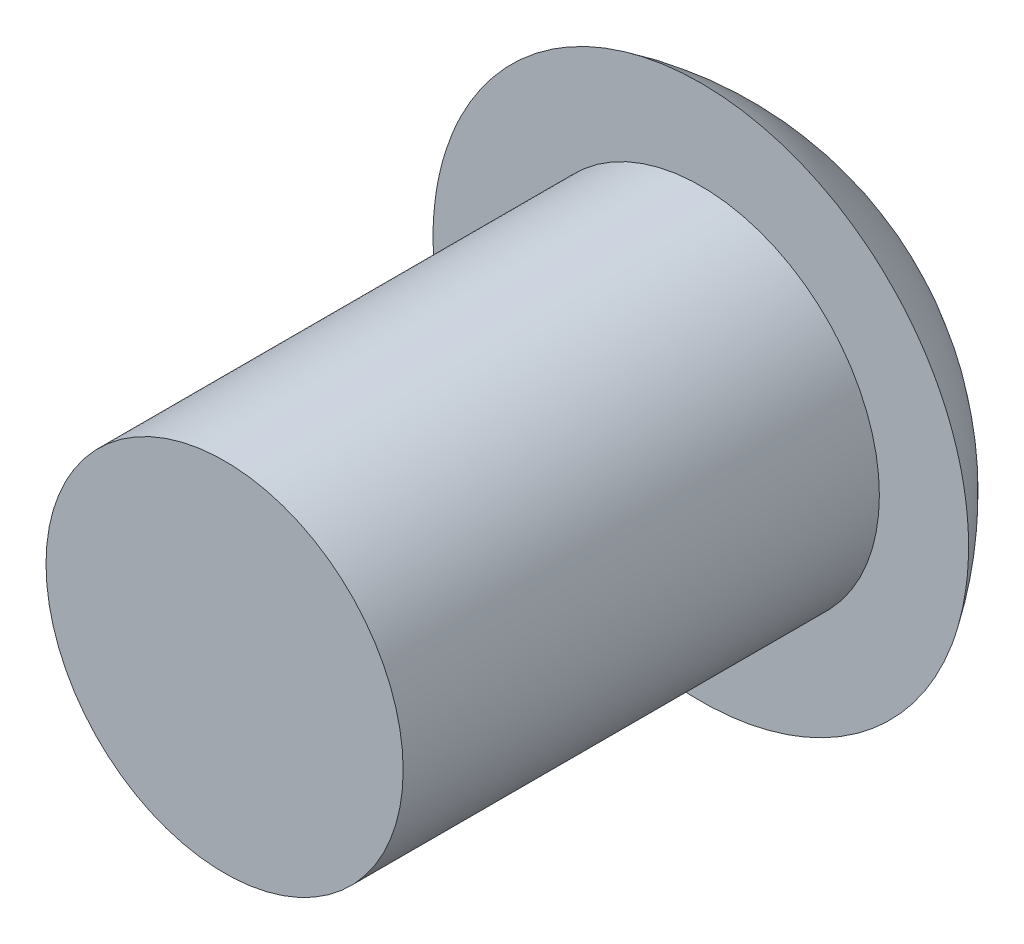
ISO-10303-21;
HEADER;
FILE_DESCRIPTION(('STEP AP214'),'2;1');
FILE_NAME('part.step','',(''),(''),'','','');
FILE_SCHEMA(('AUTOMOTIVE_DESIGN { 1 0 10303 214 1 1 1 1 }'));
ENDSEC;
DATA;
#1=APPLICATION_CONTEXT('core data for automotive mechanical design processes');
#2=APPLICATION_PROTOCOL_DEFINITION('international standard','automotive_design',2000,#1);
#3=PRODUCT_CONTEXT('',#1,'mechanical');
#4=PRODUCT('Part','Part','',(#3));
#5=PRODUCT_RELATED_PRODUCT_CATEGORY('part','',(#4));
#6=PRODUCT_DEFINITION_FORMATION('','',#4);
#7=PRODUCT_DEFINITION_CONTEXT('part definition',#1,'design');
#8=PRODUCT_DEFINITION('design','',#6,#7);
#9=PRODUCT_DEFINITION_SHAPE('','',#8);
#10=(LENGTH_UNIT() NAMED_UNIT(*) SI_UNIT(.MILLI.,.METRE.));
#11=(NAMED_UNIT(*) PLANE_ANGLE_UNIT() SI_UNIT($,.RADIAN.));
#12=(NAMED_UNIT(*) SI_UNIT($,.STERADIAN.) SOLID_ANGLE_UNIT());
#13=UNCERTAINTY_MEASURE_WITH_UNIT(LENGTH_MEASURE(1.E-05),#10,'distance_accuracy_value','');
#14=(GEOMETRIC_REPRESENTATION_CONTEXT(3) GLOBAL_UNCERTAINTY_ASSIGNED_CONTEXT((#13)) GLOBAL_UNIT_ASSIGNED_CONTEXT((#10,
#11,#12)) REPRESENTATION_CONTEXT('',''));
#15=CARTESIAN_POINT('',(0.,0.,0.));
#16=DIRECTION('',(0.,0.,1.));
#17=DIRECTION('',(1.,0.,0.));
#18=AXIS2_PLACEMENT_3D('',#15,#16,#17);
#19=CARTESIAN_POINT('',(-4.064,11.1125,2.44475));
#20=DIRECTION('',(0.,0.,1.));
#21=DIRECTION('',(1.,0.,0.));
#22=AXIS2_PLACEMENT_3D('',#19,#20,#21);
#23=PLANE('',#22);
#24=CARTESIAN_POINT('',(-4.064,11.1125,2.44475));
#25=DIRECTION('',(0.,0.,1.));
#26=DIRECTION('',(1.,0.,0.));
#27=AXIS2_PLACEMENT_3D('',#24,#25,#26);
#28=CIRCLE('',#27,1.190625);
#29=CARTESIAN_POINT('',(-2.873375,11.1125,2.44475));
#30=VERTEX_POINT('',#29);
#31=EDGE_CURVE('E21',#30,#30,#28,.F.);
#32=ORIENTED_EDGE('',*,*,#31,.F.);
#33=EDGE_LOOP('',(#32));
#34=FACE_BOUND('',#33,.T.);
#35=ADVANCED_FACE('F15',(#34),#23,.T.);
#36=CARTESIAN_POINT('',(-4.064,11.1125,-0.73025));
#37=DIRECTION('',(0.,0.,1.));
#38=DIRECTION('',(1.,0.,0.));
#39=AXIS2_PLACEMENT_3D('',#36,#37,#38);
#40=CYLINDRICAL_SURFACE('',#39,1.190625);
#41=ORIENTED_EDGE('',*,*,#31,.T.);
#42=EDGE_LOOP('',(#41));
#43=FACE_BOUND('',#42,.T.);
#44=CARTESIAN_POINT('',(-4.064,11.1125,-0.73025));
#45=DIRECTION('',(0.,0.,1.));
#46=DIRECTION('',(1.,0.,0.));
#47=AXIS2_PLACEMENT_3D('',#44,#45,#46);
#48=CIRCLE('',#47,1.190625);
#49=CARTESIAN_POINT('',(-2.873375,11.1125,-0.73025));
#50=VERTEX_POINT('',#49);
#51=EDGE_CURVE('E25',#50,#50,#48,.T.);
#52=ORIENTED_EDGE('',*,*,#51,.T.);
#53=EDGE_LOOP('',(#52));
#54=FACE_BOUND('',#53,.T.);
#55=ADVANCED_FACE('F37',(#43,#54),#40,.T.);
#56=CARTESIAN_POINT('',(-4.064,9.32725760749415,-0.73025));
#57=DIRECTION('',(0.,0.,-1.));
#58=DIRECTION('',(-1.,0.,0.));
#59=AXIS2_PLACEMENT_3D('',#56,#57,#58);
#60=PLANE('',#59);
#61=CARTESIAN_POINT('',(-5.84924239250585,11.1125,-0.73025));
#62=CARTESIAN_POINT('',(-5.84923794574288,11.2127778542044,-0.73025));
#63=CARTESIAN_POINT('',(-5.84076506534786,11.3131284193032,-0.73025));
#64=CARTESIAN_POINT('',(-5.80708264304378,11.5110658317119,-0.73025));
#65=CARTESIAN_POINT('',(-5.78185295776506,11.6086492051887,-0.73025));
#66=CARTESIAN_POINT('',(-5.71537515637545,11.7981559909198,-0.73025));
#67=CARTESIAN_POINT('',(-5.67413469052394,11.890082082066,-0.73025));
#68=CARTESIAN_POINT('',(-5.57681650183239,12.0656800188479,-0.73025));
#69=CARTESIAN_POINT('',(-5.52074246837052,12.1493539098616,-0.73025));
#70=CARTESIAN_POINT('',(-5.39533755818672,12.3061104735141,-0.730250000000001));
#71=CARTESIAN_POINT('',(-5.32600529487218,12.3791920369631,-0.730250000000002));
#72=CARTESIAN_POINT('',(-5.17605274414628,12.5126806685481,-0.730249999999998));
#73=CARTESIAN_POINT('',(-5.09543201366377,12.5730872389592,-0.730249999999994));
#74=CARTESIAN_POINT('',(-4.92519488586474,12.6795066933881,-0.730249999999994));
#75=CARTESIAN_POINT('',(-4.83557865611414,12.7255198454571,-0.730249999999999));
#76=CARTESIAN_POINT('',(-4.64989339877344,12.8018476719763,-0.730250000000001));
#77=CARTESIAN_POINT('',(-4.55382438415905,12.8321623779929,-0.730249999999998));
#78=CARTESIAN_POINT('',(-4.35796032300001,12.8762329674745,-0.730249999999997));
#79=CARTESIAN_POINT('',(-4.25816526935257,12.8899888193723,-0.730249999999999));
#80=CARTESIAN_POINT('',(-4.05768237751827,12.9005510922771,-0.730250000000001));
#81=CARTESIAN_POINT('',(-3.95699454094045,12.8973575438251,-0.73025));
#82=CARTESIAN_POINT('',(-3.7575840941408,12.874111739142,-0.730249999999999));
#83=CARTESIAN_POINT('',(-3.65886148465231,12.8540594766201,-0.73025));
#84=CARTESIAN_POINT('',(-3.46618387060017,12.7976654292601,-0.73025));
#85=CARTESIAN_POINT('',(-3.37222887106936,12.7613236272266,-0.73025));
#86=CARTESIAN_POINT('',(-3.19175372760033,12.6733821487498,-0.73025));
#87=CARTESIAN_POINT('',(-3.10523358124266,12.6217824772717,-0.73025));
#88=CARTESIAN_POINT('',(-2.94208419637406,12.5047900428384,-0.73025));
#89=CARTESIAN_POINT('',(-2.86545495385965,12.4393972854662,-0.73025));
#90=CARTESIAN_POINT('',(-2.7242626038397,12.2966749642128,-0.73025));
#91=CARTESIAN_POINT('',(-2.65969949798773,12.2193453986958,-0.73025));
#92=CARTESIAN_POINT('',(-2.54447218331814,12.0549446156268,-0.73025));
#93=CARTESIAN_POINT('',(-2.49380797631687,11.9678733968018,-0.730250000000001));
#94=CARTESIAN_POINT('',(-2.40781668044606,11.7864610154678,-0.730250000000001));
#95=CARTESIAN_POINT('',(-2.37248959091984,11.6921198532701,-0.73025));
#96=CARTESIAN_POINT('',(-2.31817536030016,11.4988456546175,-0.73025));
#97=CARTESIAN_POINT('',(-2.29918821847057,11.3999126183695,-0.73025));
#98=CARTESIAN_POINT('',(-2.27809286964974,11.2002630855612,-0.730250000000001));
#99=CARTESIAN_POINT('',(-2.27598466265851,11.0995465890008,-0.73025));
#100=CARTESIAN_POINT('',(-2.28870702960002,10.8991891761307,-0.73025));
#101=CARTESIAN_POINT('',(-2.30353760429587,10.7995482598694,-0.73025));
#102=CARTESIAN_POINT('',(-2.34971654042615,10.6041705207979,-0.73025));
#103=CARTESIAN_POINT('',(-2.38106490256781,10.5084336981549,-0.73025));
#104=CARTESIAN_POINT('',(-2.45938952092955,10.3235818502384,-0.73025));
#105=CARTESIAN_POINT('',(-2.50636577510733,10.2344668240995,-0.73025));
#106=CARTESIAN_POINT('',(-2.61461265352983,10.0653882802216,-0.730250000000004));
#107=CARTESIAN_POINT('',(-2.67588327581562,9.9854247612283,-0.730250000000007));
#108=CARTESIAN_POINT('',(-2.81097962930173,9.83691911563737,-0.730249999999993));
#109=CARTESIAN_POINT('',(-2.88480536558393,9.7683769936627,-0.730249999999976));
#110=CARTESIAN_POINT('',(-3.04291625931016,9.64465987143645,-0.730249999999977));
#111=CARTESIAN_POINT('',(-3.1272014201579,9.58948487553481,-0.730249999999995));
#112=CARTESIAN_POINT('',(-3.30383843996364,9.4940683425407,-0.730250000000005));
#113=CARTESIAN_POINT('',(-3.39619029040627,9.45382678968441,-0.730249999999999));
#114=CARTESIAN_POINT('',(-3.58633913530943,9.38941941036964,-0.730249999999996));
#115=CARTESIAN_POINT('',(-3.68413612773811,9.36525357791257,-0.73025));
#116=CARTESIAN_POINT('',(-3.88239930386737,9.33368358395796,-0.73025));
#117=CARTESIAN_POINT('',(-3.98286549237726,9.32627945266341,-0.730249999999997));
#118=CARTESIAN_POINT('',(-4.18361475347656,9.3284431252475,-0.730249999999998));
#119=CARTESIAN_POINT('',(-4.28389782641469,9.33801089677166,-0.730250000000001));
#120=CARTESIAN_POINT('',(-4.48143451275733,9.37384676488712,-0.730249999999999));
#121=CARTESIAN_POINT('',(-4.57868812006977,9.40011489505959,-0.730249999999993));
#122=CARTESIAN_POINT('',(-4.76740667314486,9.46860641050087,-0.730250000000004));
#123=CARTESIAN_POINT('',(-4.85887151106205,9.51083009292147,-0.73025000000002));
#124=CARTESIAN_POINT('',(-5.03341061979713,9.61003231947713,-0.73024999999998));
#125=CARTESIAN_POINT('',(-5.11648521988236,9.66701028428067,-0.730249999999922));
#126=CARTESIAN_POINT('',(-5.2718815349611,9.79409685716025,-0.730249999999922));
#127=CARTESIAN_POINT('',(-5.34420437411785,9.86420409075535,-0.73024999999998));
#128=CARTESIAN_POINT('',(-5.47607185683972,10.0155858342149,-0.73025000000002));
#129=CARTESIAN_POINT('',(-5.53561331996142,10.0968631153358,-0.730250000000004));
#130=CARTESIAN_POINT('',(-5.64022826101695,10.2682919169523,-0.730249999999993));
#131=CARTESIAN_POINT('',(-5.68529481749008,10.3584476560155,-0.730249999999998));
#132=CARTESIAN_POINT('',(-5.75960049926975,10.5449748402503,-0.730250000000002));
#133=CARTESIAN_POINT('',(-5.78885859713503,10.6413386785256,-0.73025));
#134=CARTESIAN_POINT('',(-5.82291889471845,10.8006805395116,-0.73025));
#135=CARTESIAN_POINT('',(-5.83277788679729,10.8626231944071,-0.73025));
#136=CARTESIAN_POINT('',(-5.8459410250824,10.9872011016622,-0.73025));
#137=CARTESIAN_POINT('',(-5.84924517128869,11.0498363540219,-0.73025));
#138=CARTESIAN_POINT('',(-5.84924239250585,11.1125,-0.73025));
#139=B_SPLINE_CURVE_WITH_KNOTS('',3,(#61,#62,#63,#64,#65,#66,#67,#68,#69,#70,#71,#72,#73,#74,
#75,#76,#77,#78,#79,#80,#81,#82,#83,#84,#85,#86,#87,#88,#89,#90,#91,#92,#93,#94,#95,#96,#97,#98,
#99,#100,#101,#102,#103,#104,#105,#106,#107,#108,#109,#110,#111,#112,#113,#114,#115,#116,#117,
#118,#119,#120,#121,#122,#123,#124,#125,#126,#127,#128,#129,#130,#131,#132,#133,#134,#135,#136,
#137,#138),.UNSPECIFIED.,.T.,.F.,(4,2,2,2,2,2,2,2,2,2,2,2,2,2,2,2,2,2,2,2,2,2,2,2,2,2,2,2,2,2,2,
2,2,2,2,2,2,2,4),(0.,0.300604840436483,0.601571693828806,0.902394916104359,1.20314338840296,
1.50392333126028,1.80471508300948,2.1055012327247,2.40628677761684,2.70707289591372,
3.00785847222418,3.30864416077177,3.60943016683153,3.9102160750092,4.21100186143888,
4.51178768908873,4.81257355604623,5.11335941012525,5.41414525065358,5.71493109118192,
6.01571694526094,6.31650281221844,6.61728863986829,6.91807442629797,7.21886033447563,
7.51964634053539,7.82043202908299,8.12121760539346,8.42200372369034,8.72278926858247,
9.02357541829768,9.3243671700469,9.62514711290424,9.92589558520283,10.2267188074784,
10.5276856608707,10.8282905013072,11.0161385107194,11.2039865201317),.UNSPECIFIED.);
#140=CARTESIAN_POINT('',(-5.84924239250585,11.1125,-0.73025));
#141=VERTEX_POINT('',#140);
#142=EDGE_CURVE('E10',#141,#141,#139,.T.);
#143=ORIENTED_EDGE('',*,*,#142,.F.);
#144=EDGE_LOOP('',(#143));
#145=FACE_BOUND('',#144,.T.);
#146=ORIENTED_EDGE('',*,*,#51,.F.);
#147=EDGE_LOOP('',(#146));
#148=FACE_BOUND('',#147,.T.);
#149=ADVANCED_FACE('F33',(#145,#148),#60,.F.);
#150=CARTESIAN_POINT('',(-4.064,11.1125,0.43815));
#151=DIRECTION('',(0.947008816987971,0.308139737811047,0.0906873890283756));
#152=DIRECTION('',(-0.0577036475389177,0.440944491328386,-0.895677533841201));
#153=AXIS2_PLACEMENT_3D('',#150,#151,#152);
#154=SPHERICAL_SURFACE('',#153,2.1336);
#155=ORIENTED_EDGE('',*,*,#142,.T.);
#156=EDGE_LOOP('',(#155));
#157=FACE_BOUND('',#156,.T.);
#158=ADVANCED_FACE('F17',(#157),#154,.T.);
#159=CLOSED_SHELL('',(#35,#55,#149,#158));
#160=MANIFOLD_SOLID_BREP('B1',#159);
#161=ADVANCED_BREP_SHAPE_REPRESENTATION('',(#18,#160),#14);
#162=SHAPE_DEFINITION_REPRESENTATION(#9,#161);
ENDSEC;
END-ISO-10303-21;
